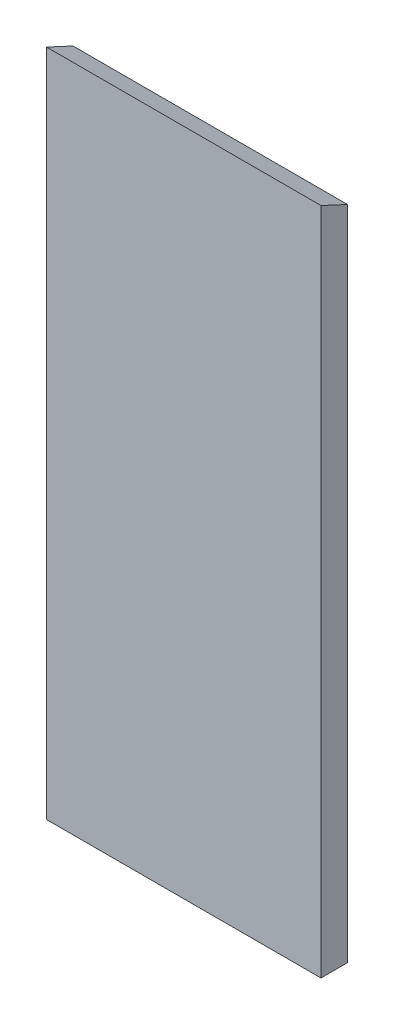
ISO-10303-21;
HEADER;
FILE_DESCRIPTION(('STEP AP214'),'2;1');
FILE_NAME('part.step','',(''),(''),'','','');
FILE_SCHEMA(('AUTOMOTIVE_DESIGN { 1 0 10303 214 1 1 1 1 }'));
ENDSEC;
DATA;
#1=APPLICATION_CONTEXT('core data for automotive mechanical design processes');
#2=APPLICATION_PROTOCOL_DEFINITION('international standard','automotive_design',2000,#1);
#3=PRODUCT_CONTEXT('',#1,'mechanical');
#4=PRODUCT('Part','Part','',(#3));
#5=PRODUCT_RELATED_PRODUCT_CATEGORY('part','',(#4));
#6=PRODUCT_DEFINITION_FORMATION('','',#4);
#7=PRODUCT_DEFINITION_CONTEXT('part definition',#1,'design');
#8=PRODUCT_DEFINITION('design','',#6,#7);
#9=PRODUCT_DEFINITION_SHAPE('','',#8);
#10=(LENGTH_UNIT() NAMED_UNIT(*) SI_UNIT(.MILLI.,.METRE.));
#11=(NAMED_UNIT(*) PLANE_ANGLE_UNIT() SI_UNIT($,.RADIAN.));
#12=(NAMED_UNIT(*) SI_UNIT($,.STERADIAN.) SOLID_ANGLE_UNIT());
#13=UNCERTAINTY_MEASURE_WITH_UNIT(LENGTH_MEASURE(1.E-05),#10,'distance_accuracy_value','');
#14=(GEOMETRIC_REPRESENTATION_CONTEXT(3) GLOBAL_UNCERTAINTY_ASSIGNED_CONTEXT((#13)) GLOBAL_UNIT_ASSIGNED_CONTEXT((#10,
#11,#12)) REPRESENTATION_CONTEXT('',''));
#15=CARTESIAN_POINT('',(0.,0.,0.));
#16=DIRECTION('',(0.,0.,1.));
#17=DIRECTION('',(1.,0.,0.));
#18=AXIS2_PLACEMENT_3D('',#15,#16,#17);
#19=CARTESIAN_POINT('',(124.,0.,0.));
#20=DIRECTION('',(0.,1.,0.));
#21=DIRECTION('',(0.,0.,1.));
#22=AXIS2_PLACEMENT_3D('',#19,#20,#21);
#23=PLANE('',#22);
#24=DIRECTION('',(0.,0.,-1.));
#25=VECTOR('',#24,1.);
#26=CARTESIAN_POINT('',(0.,0.,0.));
#27=LINE('',#26,#25);
#28=CARTESIAN_POINT('',(0.,0.,0.));
#29=VERTEX_POINT('',#28);
#30=CARTESIAN_POINT('',(0.,0.,-12.));
#31=VERTEX_POINT('',#30);
#32=EDGE_CURVE('E107',#29,#31,#27,.T.);
#33=ORIENTED_EDGE('',*,*,#32,.T.);
#34=DIRECTION('',(-1.,0.,0.));
#35=VECTOR('',#34,1.);
#36=CARTESIAN_POINT('',(124.,0.,-12.));
#37=LINE('',#36,#35);
#38=CARTESIAN_POINT('',(124.,0.,-12.));
#39=VERTEX_POINT('',#38);
#40=EDGE_CURVE('E11',#39,#31,#37,.T.);
#41=ORIENTED_EDGE('',*,*,#40,.F.);
#42=DIRECTION('',(0.,0.,-1.));
#43=VECTOR('',#42,1.);
#44=CARTESIAN_POINT('',(124.,0.,0.));
#45=LINE('',#44,#43);
#46=CARTESIAN_POINT('',(124.,0.,0.));
#47=VERTEX_POINT('',#46);
#48=EDGE_CURVE('E89',#47,#39,#45,.T.);
#49=ORIENTED_EDGE('',*,*,#48,.F.);
#50=DIRECTION('',(-1.,0.,0.));
#51=VECTOR('',#50,1.);
#52=CARTESIAN_POINT('',(124.,0.,0.));
#53=LINE('',#52,#51);
#54=EDGE_CURVE('E56',#47,#29,#53,.T.);
#55=ORIENTED_EDGE('',*,*,#54,.T.);
#56=EDGE_LOOP('',(#33,#41,#49,#55));
#57=FACE_BOUND('',#56,.T.);
#58=ADVANCED_FACE('F39',(#57),#23,.F.);
#59=CARTESIAN_POINT('',(124.,0.,-12.));
#60=DIRECTION('',(0.,0.,1.));
#61=DIRECTION('',(1.,0.,0.));
#62=AXIS2_PLACEMENT_3D('',#59,#60,#61);
#63=PLANE('',#62);
#64=DIRECTION('',(0.,1.,0.));
#65=VECTOR('',#64,1.);
#66=CARTESIAN_POINT('',(0.,0.,-12.));
#67=LINE('',#66,#65);
#68=CARTESIAN_POINT('',(0.,296.6,-12.));
#69=VERTEX_POINT('',#68);
#70=EDGE_CURVE('E95',#31,#69,#67,.T.);
#71=ORIENTED_EDGE('',*,*,#70,.T.);
#72=DIRECTION('',(-1.,0.,0.));
#73=VECTOR('',#72,1.);
#74=CARTESIAN_POINT('',(124.,296.6,-12.));
#75=LINE('',#74,#73);
#76=CARTESIAN_POINT('',(124.,296.6,-12.));
#77=VERTEX_POINT('',#76);
#78=EDGE_CURVE('E48',#77,#69,#75,.T.);
#79=ORIENTED_EDGE('',*,*,#78,.F.);
#80=DIRECTION('',(0.,1.,0.));
#81=VECTOR('',#80,1.);
#82=CARTESIAN_POINT('',(124.,0.,-12.));
#83=LINE('',#82,#81);
#84=EDGE_CURVE('E81',#39,#77,#83,.T.);
#85=ORIENTED_EDGE('',*,*,#84,.F.);
#86=ORIENTED_EDGE('',*,*,#40,.T.);
#87=EDGE_LOOP('',(#71,#79,#85,#86));
#88=FACE_BOUND('',#87,.T.);
#89=ADVANCED_FACE('F94',(#88),#63,.F.);
#90=CARTESIAN_POINT('',(124.,302.19569189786,0.));
#91=DIRECTION('',(0.,0.906307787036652,-0.422618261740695));
#92=DIRECTION('',(0.,0.422618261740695,0.906307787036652));
#93=AXIS2_PLACEMENT_3D('',#90,#91,#92);
#94=PLANE('',#93);
#95=DIRECTION('',(0.,-0.422618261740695,-0.906307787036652));
#96=VECTOR('',#95,1.);
#97=CARTESIAN_POINT('',(0.,302.19569189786,0.));
#98=LINE('',#97,#96);
#99=CARTESIAN_POINT('',(0.,302.19569189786,0.));
#100=VERTEX_POINT('',#99);
#101=EDGE_CURVE('E112',#100,#69,#98,.T.);
#102=ORIENTED_EDGE('',*,*,#101,.F.);
#103=DIRECTION('',(-1.,0.,0.));
#104=VECTOR('',#103,1.);
#105=CARTESIAN_POINT('',(124.,302.19569189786,0.));
#106=LINE('',#105,#104);
#107=CARTESIAN_POINT('',(124.,302.19569189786,0.));
#108=VERTEX_POINT('',#107);
#109=EDGE_CURVE('E70',#108,#100,#106,.T.);
#110=ORIENTED_EDGE('',*,*,#109,.F.);
#111=DIRECTION('',(0.,-0.422618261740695,-0.906307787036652));
#112=VECTOR('',#111,1.);
#113=CARTESIAN_POINT('',(124.,302.19569189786,0.));
#114=LINE('',#113,#112);
#115=EDGE_CURVE('E88',#108,#77,#114,.T.);
#116=ORIENTED_EDGE('',*,*,#115,.T.);
#117=ORIENTED_EDGE('',*,*,#78,.T.);
#118=EDGE_LOOP('',(#102,#110,#116,#117));
#119=FACE_BOUND('',#118,.T.);
#120=ADVANCED_FACE('F99',(#119),#94,.T.);
#121=CARTESIAN_POINT('',(124.,0.,0.));
#122=DIRECTION('',(0.,0.,1.));
#123=DIRECTION('',(1.,0.,0.));
#124=AXIS2_PLACEMENT_3D('',#121,#122,#123);
#125=PLANE('',#124);
#126=DIRECTION('',(0.,1.,0.));
#127=VECTOR('',#126,1.);
#128=CARTESIAN_POINT('',(0.,0.,0.));
#129=LINE('',#128,#127);
#130=EDGE_CURVE('E115',#29,#100,#129,.T.);
#131=ORIENTED_EDGE('',*,*,#130,.F.);
#132=ORIENTED_EDGE('',*,*,#54,.F.);
#133=DIRECTION('',(0.,1.,0.));
#134=VECTOR('',#133,1.);
#135=CARTESIAN_POINT('',(124.,0.,0.));
#136=LINE('',#135,#134);
#137=EDGE_CURVE('E101',#47,#108,#136,.T.);
#138=ORIENTED_EDGE('',*,*,#137,.T.);
#139=ORIENTED_EDGE('',*,*,#109,.T.);
#140=EDGE_LOOP('',(#131,#132,#138,#139));
#141=FACE_BOUND('',#140,.T.);
#142=ADVANCED_FACE('F125',(#141),#125,.T.);
#143=CARTESIAN_POINT('',(124.,0.,0.));
#144=DIRECTION('',(1.,0.,0.));
#145=DIRECTION('',(0.,0.,-1.));
#146=AXIS2_PLACEMENT_3D('',#143,#144,#145);
#147=PLANE('',#146);
#148=ORIENTED_EDGE('',*,*,#48,.T.);
#149=ORIENTED_EDGE('',*,*,#84,.T.);
#150=ORIENTED_EDGE('',*,*,#115,.F.);
#151=ORIENTED_EDGE('',*,*,#137,.F.);
#152=EDGE_LOOP('',(#148,#149,#150,#151));
#153=FACE_BOUND('',#152,.T.);
#154=ADVANCED_FACE('F85',(#153),#147,.T.);
#155=CARTESIAN_POINT('',(0.,0.,0.));
#156=DIRECTION('',(1.,0.,0.));
#157=DIRECTION('',(0.,0.,-1.));
#158=AXIS2_PLACEMENT_3D('',#155,#156,#157);
#159=PLANE('',#158);
#160=ORIENTED_EDGE('',*,*,#32,.F.);
#161=ORIENTED_EDGE('',*,*,#130,.T.);
#162=ORIENTED_EDGE('',*,*,#101,.T.);
#163=ORIENTED_EDGE('',*,*,#70,.F.);
#164=EDGE_LOOP('',(#160,#161,#162,#163));
#165=FACE_BOUND('',#164,.T.);
#166=ADVANCED_FACE('F124',(#165),#159,.F.);
#167=CLOSED_SHELL('',(#58,#89,#120,#142,#154,#166));
#168=MANIFOLD_SOLID_BREP('B2',#167);
#169=ADVANCED_BREP_SHAPE_REPRESENTATION('',(#18,#168),#14);
#170=SHAPE_DEFINITION_REPRESENTATION(#9,#169);
ENDSEC;
END-ISO-10303-21;
